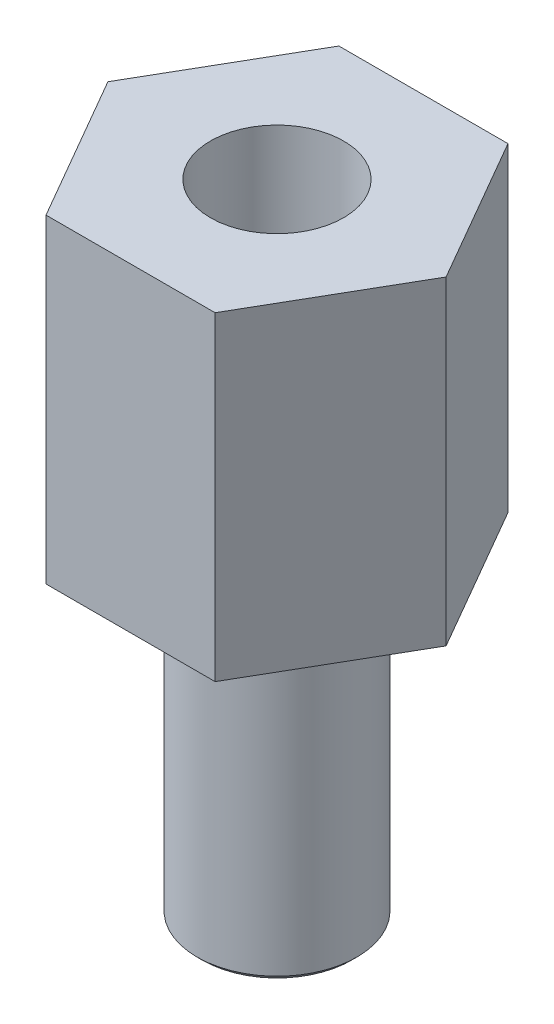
from build123d import *

# Parameters (mm, degrees)
SKETCH_1_R      = 1.25
EXTRUDE_1_DEPTH = 6
SKETCH_2_R      = 1.5
EXTRUDE_2_DEPTH = 6
CHAMFER_1_SIZE  = 0.1


with BuildPart() as part:
    # Sketch 1 → Extrude 1 (new body)
    with BuildSketch(Plane(origin=(0, 0, 0), x_dir=(1, 0, 0), z_dir=(0, 1, 0))):
        Polygon((3.175426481, 0), (1.58771324, 2.75), (-1.58771324, 2.75), (-3.175426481, 0), (-1.58771324, -2.75), (1.58771324, -2.75), align=None)
        with Locations(Location((0, 0, 0), (0, 0, 270))):
            Circle(SKETCH_1_R, mode=Mode.SUBTRACT)
    extrude(amount=EXTRUDE_1_DEPTH)

    # Sketch 2 → Extrude 2 (add)
    with BuildSketch(Plane.XZ):
        with Locations(Location((0, 0, 0), (0, 0, 90))):
            Circle(SKETCH_2_R)
    extrude(amount=EXTRUDE_2_DEPTH)

    # Chamfer 1
    chamfer_1_edges = [part.edges().sort_by_distance(p)[0] for p in [
        (0, -6, -1.5),
    ]]
    chamfer(chamfer_1_edges, length=CHAMFER_1_SIZE)


solid = part.part
